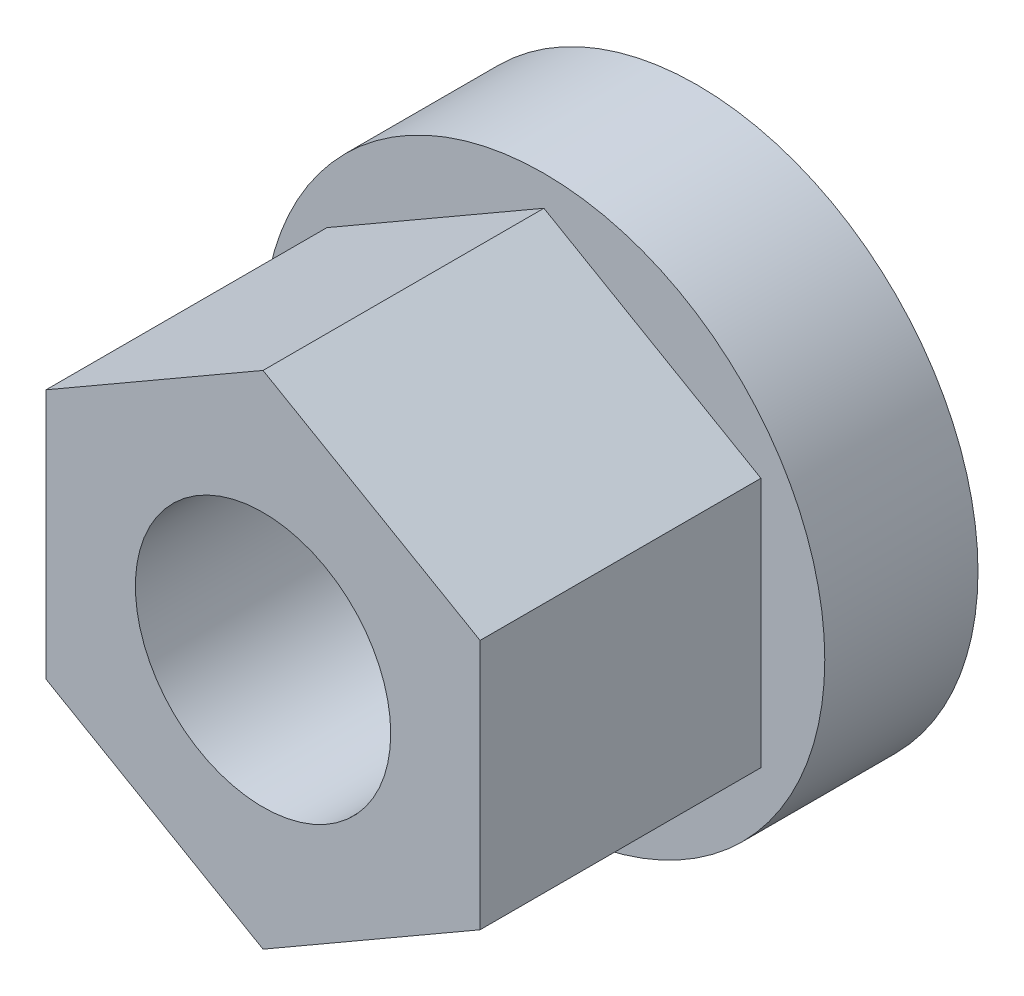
ISO-10303-21;
HEADER;
FILE_DESCRIPTION(('STEP AP214'),'2;1');
FILE_NAME('part.step','',(''),(''),'','','');
FILE_SCHEMA(('AUTOMOTIVE_DESIGN { 1 0 10303 214 1 1 1 1 }'));
ENDSEC;
DATA;
#1=APPLICATION_CONTEXT('core data for automotive mechanical design processes');
#2=APPLICATION_PROTOCOL_DEFINITION('international standard','automotive_design',2000,#1);
#3=PRODUCT_CONTEXT('',#1,'mechanical');
#4=PRODUCT('Part','Part','',(#3));
#5=PRODUCT_RELATED_PRODUCT_CATEGORY('part','',(#4));
#6=PRODUCT_DEFINITION_FORMATION('','',#4);
#7=PRODUCT_DEFINITION_CONTEXT('part definition',#1,'design');
#8=PRODUCT_DEFINITION('design','',#6,#7);
#9=PRODUCT_DEFINITION_SHAPE('','',#8);
#10=(LENGTH_UNIT() NAMED_UNIT(*) SI_UNIT(.MILLI.,.METRE.));
#11=(NAMED_UNIT(*) PLANE_ANGLE_UNIT() SI_UNIT($,.RADIAN.));
#12=(NAMED_UNIT(*) SI_UNIT($,.STERADIAN.) SOLID_ANGLE_UNIT());
#13=UNCERTAINTY_MEASURE_WITH_UNIT(LENGTH_MEASURE(1.E-05),#10,'distance_accuracy_value','');
#14=(GEOMETRIC_REPRESENTATION_CONTEXT(3) GLOBAL_UNCERTAINTY_ASSIGNED_CONTEXT((#13)) GLOBAL_UNIT_ASSIGNED_CONTEXT((#10,
#11,#12)) REPRESENTATION_CONTEXT('',''));
#15=CARTESIAN_POINT('',(0.,0.,0.));
#16=DIRECTION('',(0.,0.,1.));
#17=DIRECTION('',(1.,0.,0.));
#18=AXIS2_PLACEMENT_3D('',#15,#16,#17);
#19=CARTESIAN_POINT('',(-11.,0.,17.));
#20=DIRECTION('',(0.,0.,-1.));
#21=DIRECTION('',(-1.,0.,0.));
#22=AXIS2_PLACEMENT_3D('',#19,#20,#21);
#23=PLANE('',#22);
#24=CARTESIAN_POINT('',(0.,0.,17.));
#25=DIRECTION('',(0.,0.,1.));
#26=DIRECTION('',(1.,0.,0.));
#27=AXIS2_PLACEMENT_3D('',#24,#25,#26);
#28=CIRCLE('',#27,5.);
#29=CARTESIAN_POINT('',(5.,0.,17.));
#30=VERTEX_POINT('',#29);
#31=EDGE_CURVE('E9',#30,#30,#28,.T.);
#32=ORIENTED_EDGE('',*,*,#31,.F.);
#33=EDGE_LOOP('',(#32));
#34=FACE_BOUND('',#33,.T.);
#35=DIRECTION('',(0.86602540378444,-0.5,0.));
#36=VECTOR('',#35,1.);
#37=CARTESIAN_POINT('',(-8.5,-4.90747728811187,17.));
#38=LINE('',#37,#36);
#39=CARTESIAN_POINT('',(-8.5,-4.90747728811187,17.));
#40=VERTEX_POINT('',#39);
#41=CARTESIAN_POINT('',(0.,-9.81495457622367,17.));
#42=VERTEX_POINT('',#41);
#43=EDGE_CURVE('E87',#40,#42,#38,.T.);
#44=ORIENTED_EDGE('',*,*,#43,.T.);
#45=DIRECTION('',(0.866025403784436,0.5,0.));
#46=VECTOR('',#45,1.);
#47=CARTESIAN_POINT('',(0.,-9.81495457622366,17.));
#48=LINE('',#47,#46);
#49=CARTESIAN_POINT('',(8.5,-4.90747728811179,17.));
#50=VERTEX_POINT('',#49);
#51=EDGE_CURVE('E85',#42,#50,#48,.T.);
#52=ORIENTED_EDGE('',*,*,#51,.T.);
#53=DIRECTION('',(0.,1.,0.));
#54=VECTOR('',#53,1.);
#55=CARTESIAN_POINT('',(8.5,-4.90747728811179,17.));
#56=LINE('',#55,#54);
#57=CARTESIAN_POINT('',(8.5,4.90747728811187,17.));
#58=VERTEX_POINT('',#57);
#59=EDGE_CURVE('E29',#50,#58,#56,.T.);
#60=ORIENTED_EDGE('',*,*,#59,.T.);
#61=DIRECTION('',(-0.866025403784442,0.5,0.));
#62=VECTOR('',#61,1.);
#63=CARTESIAN_POINT('',(8.5,4.90747728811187,17.));
#64=LINE('',#63,#62);
#65=CARTESIAN_POINT('',(0.,9.81495457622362,17.));
#66=VERTEX_POINT('',#65);
#67=EDGE_CURVE('E75',#58,#66,#64,.T.);
#68=ORIENTED_EDGE('',*,*,#67,.T.);
#69=DIRECTION('',(-0.86602540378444,-0.5,0.));
#70=VECTOR('',#69,1.);
#71=CARTESIAN_POINT('',(0.,9.81495457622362,17.));
#72=LINE('',#71,#70);
#73=CARTESIAN_POINT('',(-8.5,4.90747728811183,17.));
#74=VERTEX_POINT('',#73);
#75=EDGE_CURVE('E80',#66,#74,#72,.T.);
#76=ORIENTED_EDGE('',*,*,#75,.T.);
#77=DIRECTION('',(0.,-1.,0.));
#78=VECTOR('',#77,1.);
#79=CARTESIAN_POINT('',(-8.5,4.90747728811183,17.));
#80=LINE('',#79,#78);
#81=EDGE_CURVE('E108',#74,#40,#80,.T.);
#82=ORIENTED_EDGE('',*,*,#81,.T.);
#83=EDGE_LOOP('',(#44,#52,#60,#68,#76,#82));
#84=FACE_BOUND('',#83,.T.);
#85=ADVANCED_FACE('F14',(#34,#84),#23,.F.);
#86=CARTESIAN_POINT('',(0.,0.,20.));
#87=DIRECTION('',(0.,0.,1.));
#88=DIRECTION('',(1.,0.,0.));
#89=AXIS2_PLACEMENT_3D('',#86,#87,#88);
#90=CYLINDRICAL_SURFACE('',#89,11.);
#91=CARTESIAN_POINT('',(0.,0.,0.));
#92=DIRECTION('',(0.,0.,1.));
#93=DIRECTION('',(1.,0.,0.));
#94=AXIS2_PLACEMENT_3D('',#91,#92,#93);
#95=CIRCLE('',#94,11.);
#96=CARTESIAN_POINT('',(11.,0.,0.));
#97=VERTEX_POINT('',#96);
#98=EDGE_CURVE('E116',#97,#97,#95,.T.);
#99=ORIENTED_EDGE('',*,*,#98,.T.);
#100=EDGE_LOOP('',(#99));
#101=FACE_BOUND('',#100,.T.);
#102=CARTESIAN_POINT('',(0.,0.,6.));
#103=DIRECTION('',(0.,0.,1.));
#104=DIRECTION('',(1.,0.,0.));
#105=AXIS2_PLACEMENT_3D('',#102,#103,#104);
#106=CIRCLE('',#105,11.);
#107=CARTESIAN_POINT('',(11.,0.,6.));
#108=VERTEX_POINT('',#107);
#109=EDGE_CURVE('E17',#108,#108,#106,.T.);
#110=ORIENTED_EDGE('',*,*,#109,.F.);
#111=EDGE_LOOP('',(#110));
#112=FACE_BOUND('',#111,.T.);
#113=ADVANCED_FACE('F127',(#101,#112),#90,.T.);
#114=CARTESIAN_POINT('',(0.,0.,20.));
#115=DIRECTION('',(0.,0.,1.));
#116=DIRECTION('',(1.,0.,0.));
#117=AXIS2_PLACEMENT_3D('',#114,#115,#116);
#118=CYLINDRICAL_SURFACE('',#117,5.);
#119=CARTESIAN_POINT('',(0.,0.,0.));
#120=DIRECTION('',(0.,0.,1.));
#121=DIRECTION('',(1.,0.,0.));
#122=AXIS2_PLACEMENT_3D('',#119,#120,#121);
#123=CIRCLE('',#122,5.);
#124=CARTESIAN_POINT('',(5.,0.,0.));
#125=VERTEX_POINT('',#124);
#126=EDGE_CURVE('E22',#125,#125,#123,.T.);
#127=ORIENTED_EDGE('',*,*,#126,.F.);
#128=EDGE_LOOP('',(#127));
#129=FACE_BOUND('',#128,.T.);
#130=ORIENTED_EDGE('',*,*,#31,.T.);
#131=EDGE_LOOP('',(#130));
#132=FACE_BOUND('',#131,.T.);
#133=ADVANCED_FACE('F124',(#129,#132),#118,.F.);
#134=CARTESIAN_POINT('',(-5.,0.,0.));
#135=DIRECTION('',(0.,0.,1.));
#136=DIRECTION('',(1.,0.,0.));
#137=AXIS2_PLACEMENT_3D('',#134,#135,#136);
#138=PLANE('',#137);
#139=ORIENTED_EDGE('',*,*,#98,.F.);
#140=EDGE_LOOP('',(#139));
#141=FACE_BOUND('',#140,.T.);
#142=ORIENTED_EDGE('',*,*,#126,.T.);
#143=EDGE_LOOP('',(#142));
#144=FACE_BOUND('',#143,.T.);
#145=ADVANCED_FACE('F122',(#141,#144),#138,.F.);
#146=CARTESIAN_POINT('',(0.,0.,6.));
#147=DIRECTION('',(0.,0.,1.));
#148=DIRECTION('',(1.,0.,0.));
#149=AXIS2_PLACEMENT_3D('',#146,#147,#148);
#150=PLANE('',#149);
#151=DIRECTION('',(0.,-1.,0.));
#152=VECTOR('',#151,1.);
#153=CARTESIAN_POINT('',(-8.5,4.90747728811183,6.));
#154=LINE('',#153,#152);
#155=CARTESIAN_POINT('',(-8.5,4.90747728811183,6.));
#156=VERTEX_POINT('',#155);
#157=CARTESIAN_POINT('',(-8.5,-4.90747728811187,6.));
#158=VERTEX_POINT('',#157);
#159=EDGE_CURVE('E92',#156,#158,#154,.T.);
#160=ORIENTED_EDGE('',*,*,#159,.F.);
#161=DIRECTION('',(-0.86602540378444,-0.5,0.));
#162=VECTOR('',#161,1.);
#163=CARTESIAN_POINT('',(0.,9.81495457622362,6.));
#164=LINE('',#163,#162);
#165=CARTESIAN_POINT('',(0.,9.81495457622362,6.));
#166=VERTEX_POINT('',#165);
#167=EDGE_CURVE('E96',#166,#156,#164,.T.);
#168=ORIENTED_EDGE('',*,*,#167,.F.);
#169=DIRECTION('',(-0.866025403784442,0.5,0.));
#170=VECTOR('',#169,1.);
#171=CARTESIAN_POINT('',(8.5,4.90747728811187,6.));
#172=LINE('',#171,#170);
#173=CARTESIAN_POINT('',(8.5,4.90747728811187,6.));
#174=VERTEX_POINT('',#173);
#175=EDGE_CURVE('E99',#174,#166,#172,.T.);
#176=ORIENTED_EDGE('',*,*,#175,.F.);
#177=DIRECTION('',(0.,1.,0.));
#178=VECTOR('',#177,1.);
#179=CARTESIAN_POINT('',(8.5,-4.90747728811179,6.));
#180=LINE('',#179,#178);
#181=CARTESIAN_POINT('',(8.5,-4.90747728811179,6.));
#182=VERTEX_POINT('',#181);
#183=EDGE_CURVE('E37',#182,#174,#180,.T.);
#184=ORIENTED_EDGE('',*,*,#183,.F.);
#185=DIRECTION('',(0.866025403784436,0.5,0.));
#186=VECTOR('',#185,1.);
#187=CARTESIAN_POINT('',(0.,-9.81495457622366,6.));
#188=LINE('',#187,#186);
#189=CARTESIAN_POINT('',(0.,-9.81495457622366,6.));
#190=VERTEX_POINT('',#189);
#191=EDGE_CURVE('E102',#190,#182,#188,.T.);
#192=ORIENTED_EDGE('',*,*,#191,.F.);
#193=DIRECTION('',(0.86602540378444,-0.5,0.));
#194=VECTOR('',#193,1.);
#195=CARTESIAN_POINT('',(-8.5,-4.90747728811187,6.));
#196=LINE('',#195,#194);
#197=EDGE_CURVE('E105',#158,#190,#196,.T.);
#198=ORIENTED_EDGE('',*,*,#197,.F.);
#199=EDGE_LOOP('',(#160,#168,#176,#184,#192,#198));
#200=FACE_BOUND('',#199,.T.);
#201=ORIENTED_EDGE('',*,*,#109,.T.);
#202=EDGE_LOOP('',(#201));
#203=FACE_BOUND('',#202,.T.);
#204=ADVANCED_FACE('F144',(#200,#203),#150,.T.);
#205=CARTESIAN_POINT('',(-8.5,-4.90747728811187,6.));
#206=DIRECTION('',(-0.5,-0.86602540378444,0.));
#207=DIRECTION('',(0.86602540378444,-0.5,0.));
#208=AXIS2_PLACEMENT_3D('',#205,#206,#207);
#209=PLANE('',#208);
#210=DIRECTION('',(0.,0.,1.));
#211=VECTOR('',#210,1.);
#212=CARTESIAN_POINT('',(-8.5,-4.90747728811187,6.));
#213=LINE('',#212,#211);
#214=EDGE_CURVE('E114',#158,#40,#213,.T.);
#215=ORIENTED_EDGE('',*,*,#214,.F.);
#216=ORIENTED_EDGE('',*,*,#197,.T.);
#217=DIRECTION('',(0.,0.,1.));
#218=VECTOR('',#217,1.);
#219=CARTESIAN_POINT('',(0.,-9.81495457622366,6.));
#220=LINE('',#219,#218);
#221=EDGE_CURVE('E95',#190,#42,#220,.T.);
#222=ORIENTED_EDGE('',*,*,#221,.T.);
#223=ORIENTED_EDGE('',*,*,#43,.F.);
#224=EDGE_LOOP('',(#215,#216,#222,#223));
#225=FACE_BOUND('',#224,.T.);
#226=ADVANCED_FACE('F152',(#225),#209,.T.);
#227=CARTESIAN_POINT('',(-8.5,4.90747728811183,6.));
#228=DIRECTION('',(-1.,0.,0.));
#229=DIRECTION('',(0.,0.,1.));
#230=AXIS2_PLACEMENT_3D('',#227,#228,#229);
#231=PLANE('',#230);
#232=DIRECTION('',(0.,0.,1.));
#233=VECTOR('',#232,1.);
#234=CARTESIAN_POINT('',(-8.5,4.90747728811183,6.));
#235=LINE('',#234,#233);
#236=EDGE_CURVE('E112',#156,#74,#235,.T.);
#237=ORIENTED_EDGE('',*,*,#236,.F.);
#238=ORIENTED_EDGE('',*,*,#159,.T.);
#239=ORIENTED_EDGE('',*,*,#214,.T.);
#240=ORIENTED_EDGE('',*,*,#81,.F.);
#241=EDGE_LOOP('',(#237,#238,#239,#240));
#242=FACE_BOUND('',#241,.T.);
#243=ADVANCED_FACE('F158',(#242),#231,.T.);
#244=CARTESIAN_POINT('',(0.,9.81495457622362,6.));
#245=DIRECTION('',(-0.5,0.86602540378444,0.));
#246=DIRECTION('',(-0.86602540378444,-0.5,0.));
#247=AXIS2_PLACEMENT_3D('',#244,#245,#246);
#248=PLANE('',#247);
#249=DIRECTION('',(0.,0.,1.));
#250=VECTOR('',#249,1.);
#251=CARTESIAN_POINT('',(0.,9.81495457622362,6.));
#252=LINE('',#251,#250);
#253=EDGE_CURVE('E71',#166,#66,#252,.T.);
#254=ORIENTED_EDGE('',*,*,#253,.F.);
#255=ORIENTED_EDGE('',*,*,#167,.T.);
#256=ORIENTED_EDGE('',*,*,#236,.T.);
#257=ORIENTED_EDGE('',*,*,#75,.F.);
#258=EDGE_LOOP('',(#254,#255,#256,#257));
#259=FACE_BOUND('',#258,.T.);
#260=ADVANCED_FACE('F169',(#259),#248,.T.);
#261=CARTESIAN_POINT('',(8.5,4.90747728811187,6.));
#262=DIRECTION('',(0.5,0.866025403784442,0.));
#263=DIRECTION('',(-0.866025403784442,0.5,0.));
#264=AXIS2_PLACEMENT_3D('',#261,#262,#263);
#265=PLANE('',#264);
#266=DIRECTION('',(0.,0.,1.));
#267=VECTOR('',#266,1.);
#268=CARTESIAN_POINT('',(8.5,4.90747728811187,6.));
#269=LINE('',#268,#267);
#270=EDGE_CURVE('E66',#174,#58,#269,.T.);
#271=ORIENTED_EDGE('',*,*,#270,.F.);
#272=ORIENTED_EDGE('',*,*,#175,.T.);
#273=ORIENTED_EDGE('',*,*,#253,.T.);
#274=ORIENTED_EDGE('',*,*,#67,.F.);
#275=EDGE_LOOP('',(#271,#272,#273,#274));
#276=FACE_BOUND('',#275,.T.);
#277=ADVANCED_FACE('F76',(#276),#265,.T.);
#278=CARTESIAN_POINT('',(8.5,-4.90747728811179,6.));
#279=DIRECTION('',(1.,0.,0.));
#280=DIRECTION('',(0.,1.,0.));
#281=AXIS2_PLACEMENT_3D('',#278,#279,#280);
#282=PLANE('',#281);
#283=DIRECTION('',(0.,0.,1.));
#284=VECTOR('',#283,1.);
#285=CARTESIAN_POINT('',(8.5,-4.90747728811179,6.));
#286=LINE('',#285,#284);
#287=EDGE_CURVE('E72',#182,#50,#286,.T.);
#288=ORIENTED_EDGE('',*,*,#287,.F.);
#289=ORIENTED_EDGE('',*,*,#183,.T.);
#290=ORIENTED_EDGE('',*,*,#270,.T.);
#291=ORIENTED_EDGE('',*,*,#59,.F.);
#292=EDGE_LOOP('',(#288,#289,#290,#291));
#293=FACE_BOUND('',#292,.T.);
#294=ADVANCED_FACE('F68',(#293),#282,.T.);
#295=CARTESIAN_POINT('',(0.,-9.81495457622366,6.));
#296=DIRECTION('',(0.5,-0.866025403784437,0.));
#297=DIRECTION('',(0.866025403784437,0.5,0.));
#298=AXIS2_PLACEMENT_3D('',#295,#296,#297);
#299=PLANE('',#298);
#300=ORIENTED_EDGE('',*,*,#191,.T.);
#301=ORIENTED_EDGE('',*,*,#287,.T.);
#302=ORIENTED_EDGE('',*,*,#51,.F.);
#303=ORIENTED_EDGE('',*,*,#221,.F.);
#304=EDGE_LOOP('',(#300,#301,#302,#303));
#305=FACE_BOUND('',#304,.T.);
#306=ADVANCED_FACE('F175',(#305),#299,.T.);
#307=CLOSED_SHELL('',(#85,#113,#133,#145,#204,#226,#243,#260,#277,#294,#306));
#308=MANIFOLD_SOLID_BREP('B1',#307);
#309=ADVANCED_BREP_SHAPE_REPRESENTATION('',(#18,#308),#14);
#310=SHAPE_DEFINITION_REPRESENTATION(#9,#309);
ENDSEC;
END-ISO-10303-21;
